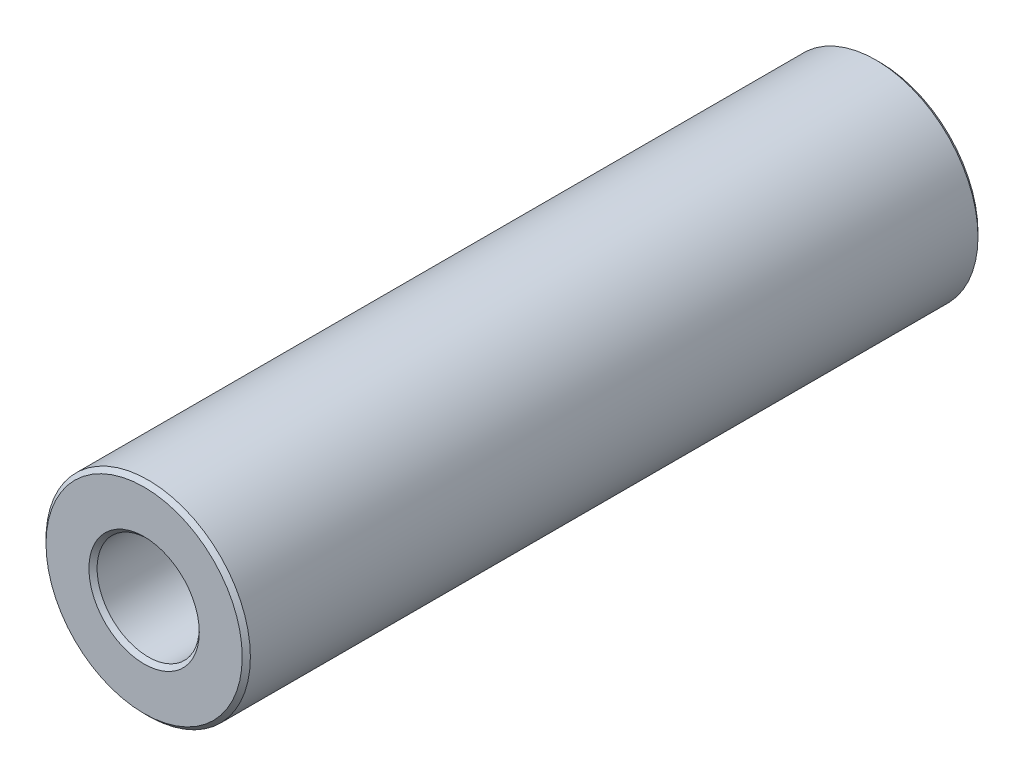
ISO-10303-21;
HEADER;
FILE_DESCRIPTION(('STEP AP214'),'2;1');
FILE_NAME('part.step','',(''),(''),'','','');
FILE_SCHEMA(('AUTOMOTIVE_DESIGN { 1 0 10303 214 1 1 1 1 }'));
ENDSEC;
DATA;
#1=APPLICATION_CONTEXT('core data for automotive mechanical design processes');
#2=APPLICATION_PROTOCOL_DEFINITION('international standard','automotive_design',2000,#1);
#3=PRODUCT_CONTEXT('',#1,'mechanical');
#4=PRODUCT('Part','Part','',(#3));
#5=PRODUCT_RELATED_PRODUCT_CATEGORY('part','',(#4));
#6=PRODUCT_DEFINITION_FORMATION('','',#4);
#7=PRODUCT_DEFINITION_CONTEXT('part definition',#1,'design');
#8=PRODUCT_DEFINITION('design','',#6,#7);
#9=PRODUCT_DEFINITION_SHAPE('','',#8);
#10=(LENGTH_UNIT() NAMED_UNIT(*) SI_UNIT(.MILLI.,.METRE.));
#11=(NAMED_UNIT(*) PLANE_ANGLE_UNIT() SI_UNIT($,.RADIAN.));
#12=(NAMED_UNIT(*) SI_UNIT($,.STERADIAN.) SOLID_ANGLE_UNIT());
#13=UNCERTAINTY_MEASURE_WITH_UNIT(LENGTH_MEASURE(1.E-05),#10,'distance_accuracy_value','');
#14=(GEOMETRIC_REPRESENTATION_CONTEXT(3) GLOBAL_UNCERTAINTY_ASSIGNED_CONTEXT((#13)) GLOBAL_UNIT_ASSIGNED_CONTEXT((#10,
#11,#12)) REPRESENTATION_CONTEXT('',''));
#15=CARTESIAN_POINT('',(0.,0.,0.));
#16=DIRECTION('',(0.,0.,1.));
#17=DIRECTION('',(1.,0.,0.));
#18=AXIS2_PLACEMENT_3D('',#15,#16,#17);
#19=CARTESIAN_POINT('',(0.,0.,9.));
#20=DIRECTION('',(0.,0.,1.));
#21=DIRECTION('',(1.,0.,0.));
#22=AXIS2_PLACEMENT_3D('',#19,#20,#21);
#23=PLANE('',#22);
#24=CARTESIAN_POINT('',(0.,0.,9.));
#25=DIRECTION('',(0.,0.,1.));
#26=DIRECTION('',(1.,0.,0.));
#27=AXIS2_PLACEMENT_3D('',#24,#25,#26);
#28=CIRCLE('',#27,1.35);
#29=CARTESIAN_POINT('',(1.35,0.,9.));
#30=VERTEX_POINT('',#29);
#31=EDGE_CURVE('E10',#30,#30,#28,.F.);
#32=ORIENTED_EDGE('',*,*,#31,.T.);
#33=EDGE_LOOP('',(#32));
#34=FACE_BOUND('',#33,.T.);
#35=CARTESIAN_POINT('',(0.,0.,9.));
#36=DIRECTION('',(0.,0.,1.));
#37=DIRECTION('',(1.,0.,0.));
#38=AXIS2_PLACEMENT_3D('',#35,#36,#37);
#39=CIRCLE('',#38,2.4);
#40=CARTESIAN_POINT('',(2.4,0.,9.));
#41=VERTEX_POINT('',#40);
#42=EDGE_CURVE('E45',#41,#41,#39,.T.);
#43=ORIENTED_EDGE('',*,*,#42,.T.);
#44=EDGE_LOOP('',(#43));
#45=FACE_BOUND('',#44,.T.);
#46=ADVANCED_FACE('F37',(#34,#45),#23,.T.);
#47=CARTESIAN_POINT('',(0.,0.,-9.));
#48=DIRECTION('',(0.,0.,1.));
#49=DIRECTION('',(1.,0.,0.));
#50=AXIS2_PLACEMENT_3D('',#47,#48,#49);
#51=PLANE('',#50);
#52=CARTESIAN_POINT('',(0.,0.,-9.));
#53=DIRECTION('',(0.,0.,1.));
#54=DIRECTION('',(1.,0.,0.));
#55=AXIS2_PLACEMENT_3D('',#52,#53,#54);
#56=CIRCLE('',#55,2.4);
#57=CARTESIAN_POINT('',(2.4,0.,-9.));
#58=VERTEX_POINT('',#57);
#59=EDGE_CURVE('E65',#58,#58,#56,.F.);
#60=ORIENTED_EDGE('',*,*,#59,.T.);
#61=EDGE_LOOP('',(#60));
#62=FACE_BOUND('',#61,.T.);
#63=CARTESIAN_POINT('',(0.,0.,-9.));
#64=DIRECTION('',(0.,0.,1.));
#65=DIRECTION('',(1.,0.,0.));
#66=AXIS2_PLACEMENT_3D('',#63,#64,#65);
#67=CIRCLE('',#66,1.35);
#68=CARTESIAN_POINT('',(1.35,0.,-9.));
#69=VERTEX_POINT('',#68);
#70=EDGE_CURVE('E68',#69,#69,#67,.T.);
#71=ORIENTED_EDGE('',*,*,#70,.T.);
#72=EDGE_LOOP('',(#71));
#73=FACE_BOUND('',#72,.T.);
#74=ADVANCED_FACE('F89',(#62,#73),#51,.F.);
#75=CARTESIAN_POINT('',(0.,0.,9.));
#76=DIRECTION('',(0.,0.,-1.));
#77=DIRECTION('',(-1.,0.,0.));
#78=AXIS2_PLACEMENT_3D('',#75,#76,#77);
#79=CYLINDRICAL_SURFACE('',#78,2.5);
#80=CARTESIAN_POINT('',(0.,0.,-8.9));
#81=DIRECTION('',(0.,0.,1.));
#82=DIRECTION('',(1.,0.,0.));
#83=AXIS2_PLACEMENT_3D('',#80,#81,#82);
#84=CIRCLE('',#83,2.5);
#85=CARTESIAN_POINT('',(2.5,0.,-8.9));
#86=VERTEX_POINT('',#85);
#87=EDGE_CURVE('E71',#86,#86,#84,.T.);
#88=ORIENTED_EDGE('',*,*,#87,.T.);
#89=EDGE_LOOP('',(#88));
#90=FACE_BOUND('',#89,.T.);
#91=CARTESIAN_POINT('',(0.,0.,8.89999999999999));
#92=DIRECTION('',(0.,0.,1.));
#93=DIRECTION('',(1.,0.,0.));
#94=AXIS2_PLACEMENT_3D('',#91,#92,#93);
#95=CIRCLE('',#94,2.5);
#96=CARTESIAN_POINT('',(2.5,0.,8.89999999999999));
#97=VERTEX_POINT('',#96);
#98=EDGE_CURVE('E74',#97,#97,#95,.F.);
#99=ORIENTED_EDGE('',*,*,#98,.T.);
#100=EDGE_LOOP('',(#99));
#101=FACE_BOUND('',#100,.T.);
#102=ADVANCED_FACE('F78',(#90,#101),#79,.T.);
#103=CARTESIAN_POINT('',(0.,0.,9.));
#104=DIRECTION('',(0.,0.,-1.));
#105=DIRECTION('',(-1.,0.,0.));
#106=AXIS2_PLACEMENT_3D('',#103,#104,#105);
#107=CYLINDRICAL_SURFACE('',#106,1.25);
#108=CARTESIAN_POINT('',(0.,0.,-8.9));
#109=DIRECTION('',(0.,0.,1.));
#110=DIRECTION('',(1.,0.,0.));
#111=AXIS2_PLACEMENT_3D('',#108,#109,#110);
#112=CIRCLE('',#111,1.25);
#113=CARTESIAN_POINT('',(1.25,0.,-8.9));
#114=VERTEX_POINT('',#113);
#115=EDGE_CURVE('E52',#114,#114,#112,.F.);
#116=ORIENTED_EDGE('',*,*,#115,.T.);
#117=EDGE_LOOP('',(#116));
#118=FACE_BOUND('',#117,.T.);
#119=CARTESIAN_POINT('',(0.,0.,8.9));
#120=DIRECTION('',(0.,0.,1.));
#121=DIRECTION('',(1.,0.,0.));
#122=AXIS2_PLACEMENT_3D('',#119,#120,#121);
#123=CIRCLE('',#122,1.25);
#124=CARTESIAN_POINT('',(1.25,0.,8.9));
#125=VERTEX_POINT('',#124);
#126=EDGE_CURVE('E59',#125,#125,#123,.T.);
#127=ORIENTED_EDGE('',*,*,#126,.T.);
#128=EDGE_LOOP('',(#127));
#129=FACE_BOUND('',#128,.T.);
#130=ADVANCED_FACE('F97',(#118,#129),#107,.F.);
#131=CARTESIAN_POINT('',(0.,0.,-8.9));
#132=DIRECTION('',(0.,0.,1.));
#133=DIRECTION('',(1.,0.,0.));
#134=AXIS2_PLACEMENT_3D('',#131,#132,#133);
#135=CONICAL_SURFACE('',#134,2.5,0.785398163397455);
#136=ORIENTED_EDGE('',*,*,#59,.F.);
#137=EDGE_LOOP('',(#136));
#138=FACE_BOUND('',#137,.T.);
#139=ORIENTED_EDGE('',*,*,#87,.F.);
#140=EDGE_LOOP('',(#139));
#141=FACE_BOUND('',#140,.T.);
#142=ADVANCED_FACE('F102',(#138,#141),#135,.T.);
#143=CARTESIAN_POINT('',(0.,0.,-9.));
#144=DIRECTION('',(0.,0.,-1.));
#145=DIRECTION('',(-1.,0.,0.));
#146=AXIS2_PLACEMENT_3D('',#143,#144,#145);
#147=CONICAL_SURFACE('',#146,1.35,0.785398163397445);
#148=ORIENTED_EDGE('',*,*,#115,.F.);
#149=EDGE_LOOP('',(#148));
#150=FACE_BOUND('',#149,.T.);
#151=ORIENTED_EDGE('',*,*,#70,.F.);
#152=EDGE_LOOP('',(#151));
#153=FACE_BOUND('',#152,.T.);
#154=ADVANCED_FACE('F86',(#150,#153),#147,.F.);
#155=CARTESIAN_POINT('',(0.,0.,8.9));
#156=DIRECTION('',(0.,0.,1.));
#157=DIRECTION('',(1.,0.,0.));
#158=AXIS2_PLACEMENT_3D('',#155,#156,#157);
#159=CONICAL_SURFACE('',#158,1.25,0.785398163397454);
#160=ORIENTED_EDGE('',*,*,#31,.F.);
#161=EDGE_LOOP('',(#160));
#162=FACE_BOUND('',#161,.T.);
#163=ORIENTED_EDGE('',*,*,#126,.F.);
#164=EDGE_LOOP('',(#163));
#165=FACE_BOUND('',#164,.T.);
#166=ADVANCED_FACE('F82',(#162,#165),#159,.F.);
#167=CARTESIAN_POINT('',(0.,0.,9.));
#168=DIRECTION('',(0.,0.,-1.));
#169=DIRECTION('',(-1.,0.,0.));
#170=AXIS2_PLACEMENT_3D('',#167,#168,#169);
#171=CONICAL_SURFACE('',#170,2.4,0.785398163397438);
#172=ORIENTED_EDGE('',*,*,#98,.F.);
#173=EDGE_LOOP('',(#172));
#174=FACE_BOUND('',#173,.T.);
#175=ORIENTED_EDGE('',*,*,#42,.F.);
#176=EDGE_LOOP('',(#175));
#177=FACE_BOUND('',#176,.T.);
#178=ADVANCED_FACE('F39',(#174,#177),#171,.T.);
#179=CLOSED_SHELL('',(#46,#74,#102,#130,#142,#154,#166,#178));
#180=MANIFOLD_SOLID_BREP('B2',#179);
#181=ADVANCED_BREP_SHAPE_REPRESENTATION('',(#18,#180),#14);
#182=SHAPE_DEFINITION_REPRESENTATION(#9,#181);
ENDSEC;
END-ISO-10303-21;
